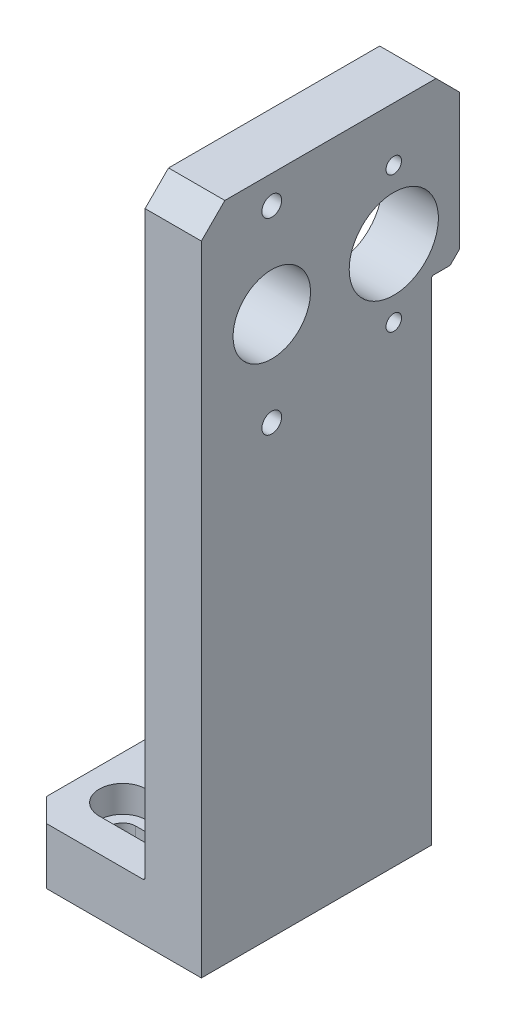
ISO-10303-21;
HEADER;
FILE_DESCRIPTION(('STEP AP214'),'2;1');
FILE_NAME('part.step','',(''),(''),'','','');
FILE_SCHEMA(('AUTOMOTIVE_DESIGN { 1 0 10303 214 1 1 1 1 }'));
ENDSEC;
DATA;
#1=APPLICATION_CONTEXT('core data for automotive mechanical design processes');
#2=APPLICATION_PROTOCOL_DEFINITION('international standard','automotive_design',2000,#1);
#3=PRODUCT_CONTEXT('',#1,'mechanical');
#4=PRODUCT('Part','Part','',(#3));
#5=PRODUCT_RELATED_PRODUCT_CATEGORY('part','',(#4));
#6=PRODUCT_DEFINITION_FORMATION('','',#4);
#7=PRODUCT_DEFINITION_CONTEXT('part definition',#1,'design');
#8=PRODUCT_DEFINITION('design','',#6,#7);
#9=PRODUCT_DEFINITION_SHAPE('','',#8);
#10=(LENGTH_UNIT() NAMED_UNIT(*) SI_UNIT(.MILLI.,.METRE.));
#11=(NAMED_UNIT(*) PLANE_ANGLE_UNIT() SI_UNIT($,.RADIAN.));
#12=(NAMED_UNIT(*) SI_UNIT($,.STERADIAN.) SOLID_ANGLE_UNIT());
#13=UNCERTAINTY_MEASURE_WITH_UNIT(LENGTH_MEASURE(1.E-05),#10,'distance_accuracy_value','');
#14=(GEOMETRIC_REPRESENTATION_CONTEXT(3) GLOBAL_UNCERTAINTY_ASSIGNED_CONTEXT((#13)) GLOBAL_UNIT_ASSIGNED_CONTEXT((#10,
#11,#12)) REPRESENTATION_CONTEXT('',''));
#15=CARTESIAN_POINT('',(0.,0.,0.));
#16=DIRECTION('',(0.,0.,1.));
#17=DIRECTION('',(1.,0.,0.));
#18=AXIS2_PLACEMENT_3D('',#15,#16,#17);
#19=CARTESIAN_POINT('',(0.,0.,55.));
#20=DIRECTION('',(0.,1.,0.));
#21=DIRECTION('',(-1.,0.,0.));
#22=AXIS2_PLACEMENT_3D('',#19,#20,#21);
#23=PLANE('',#22);
#24=DIRECTION('',(1.,0.,0.));
#25=VECTOR('',#24,1.);
#26=CARTESIAN_POINT('',(-28.75,0.,40.25));
#27=LINE('',#26,#25);
#28=CARTESIAN_POINT('',(-28.75,0.,40.25));
#29=VERTEX_POINT('',#28);
#30=CARTESIAN_POINT('',(-19.25,0.,40.25));
#31=VERTEX_POINT('',#30);
#32=EDGE_CURVE('E481',#29,#31,#27,.T.);
#33=ORIENTED_EDGE('',*,*,#32,.F.);
#34=CARTESIAN_POINT('',(-28.75,0.,43.));
#35=DIRECTION('',(0.,1.,0.));
#36=DIRECTION('',(0.,0.,1.));
#37=AXIS2_PLACEMENT_3D('',#34,#35,#36);
#38=CIRCLE('',#37,2.75);
#39=CARTESIAN_POINT('',(-28.75,0.,45.75));
#40=VERTEX_POINT('',#39);
#41=EDGE_CURVE('E503',#29,#40,#38,.T.);
#42=ORIENTED_EDGE('',*,*,#41,.T.);
#43=DIRECTION('',(1.,0.,0.));
#44=VECTOR('',#43,1.);
#45=CARTESIAN_POINT('',(-28.75,0.,45.75));
#46=LINE('',#45,#44);
#47=CARTESIAN_POINT('',(-19.25,0.,45.75));
#48=VERTEX_POINT('',#47);
#49=EDGE_CURVE('E478',#40,#48,#46,.T.);
#50=ORIENTED_EDGE('',*,*,#49,.T.);
#51=CARTESIAN_POINT('',(-19.25,0.,43.));
#52=DIRECTION('',(0.,1.,0.));
#53=DIRECTION('',(0.,0.,1.));
#54=AXIS2_PLACEMENT_3D('',#51,#52,#53);
#55=CIRCLE('',#54,2.75);
#56=EDGE_CURVE('E526',#48,#31,#55,.T.);
#57=ORIENTED_EDGE('',*,*,#56,.T.);
#58=EDGE_LOOP('',(#33,#42,#50,#57));
#59=FACE_BOUND('',#58,.T.);
#60=DIRECTION('',(0.,0.,-1.));
#61=VECTOR('',#60,1.);
#62=CARTESIAN_POINT('',(-38.,0.,55.));
#63=LINE('',#62,#61);
#64=CARTESIAN_POINT('',(-38.,0.,50.));
#65=VERTEX_POINT('',#64);
#66=CARTESIAN_POINT('',(-38.,0.,11.));
#67=VERTEX_POINT('',#66);
#68=EDGE_CURVE('E247',#65,#67,#63,.T.);
#69=ORIENTED_EDGE('',*,*,#68,.T.);
#70=DIRECTION('',(-0.70710678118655,0.,0.707106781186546));
#71=VECTOR('',#70,1.);
#72=CARTESIAN_POINT('',(-38.,0.,11.));
#73=LINE('',#72,#71);
#74=CARTESIAN_POINT('',(-33.,0.,6.));
#75=VERTEX_POINT('',#74);
#76=EDGE_CURVE('E229',#67,#75,#73,.F.);
#77=ORIENTED_EDGE('',*,*,#76,.T.);
#78=DIRECTION('',(1.,0.,0.));
#79=VECTOR('',#78,1.);
#80=CARTESIAN_POINT('',(-38.,0.,6.));
#81=LINE('',#80,#79);
#82=CARTESIAN_POINT('',(0.,0.,6.));
#83=VERTEX_POINT('',#82);
#84=EDGE_CURVE('E221',#75,#83,#81,.T.);
#85=ORIENTED_EDGE('',*,*,#84,.T.);
#86=DIRECTION('',(0.,0.,-1.));
#87=VECTOR('',#86,1.);
#88=CARTESIAN_POINT('',(0.,0.,55.));
#89=LINE('',#88,#87);
#90=CARTESIAN_POINT('',(0.,0.,55.));
#91=VERTEX_POINT('',#90);
#92=EDGE_CURVE('E227',#91,#83,#89,.T.);
#93=ORIENTED_EDGE('',*,*,#92,.F.);
#94=DIRECTION('',(1.,0.,0.));
#95=VECTOR('',#94,1.);
#96=CARTESIAN_POINT('',(0.,0.,55.));
#97=LINE('',#96,#95);
#98=CARTESIAN_POINT('',(-33.,0.,55.));
#99=VERTEX_POINT('',#98);
#100=EDGE_CURVE('E248',#99,#91,#97,.T.);
#101=ORIENTED_EDGE('',*,*,#100,.F.);
#102=DIRECTION('',(-0.707106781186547,0.,-0.707106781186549));
#103=VECTOR('',#102,1.);
#104=CARTESIAN_POINT('',(-33.,0.,55.));
#105=LINE('',#104,#103);
#106=EDGE_CURVE('E317',#99,#65,#105,.T.);
#107=ORIENTED_EDGE('',*,*,#106,.T.);
#108=EDGE_LOOP('',(#69,#77,#85,#93,#101,#107));
#109=FACE_BOUND('',#108,.T.);
#110=DIRECTION('',(1.,0.,0.));
#111=VECTOR('',#110,1.);
#112=CARTESIAN_POINT('',(-28.75,0.,9.25));
#113=LINE('',#112,#111);
#114=CARTESIAN_POINT('',(-28.75,0.,9.25));
#115=VERTEX_POINT('',#114);
#116=CARTESIAN_POINT('',(-19.25,0.,9.25));
#117=VERTEX_POINT('',#116);
#118=EDGE_CURVE('E417',#115,#117,#113,.T.);
#119=ORIENTED_EDGE('',*,*,#118,.F.);
#120=CARTESIAN_POINT('',(-28.75,0.,12.));
#121=DIRECTION('',(0.,1.,0.));
#122=DIRECTION('',(0.,0.,1.));
#123=AXIS2_PLACEMENT_3D('',#120,#121,#122);
#124=CIRCLE('',#123,2.75);
#125=CARTESIAN_POINT('',(-28.75,0.,14.75));
#126=VERTEX_POINT('',#125);
#127=EDGE_CURVE('E439',#115,#126,#124,.T.);
#128=ORIENTED_EDGE('',*,*,#127,.T.);
#129=DIRECTION('',(1.,0.,0.));
#130=VECTOR('',#129,1.);
#131=CARTESIAN_POINT('',(-28.75,0.,14.75));
#132=LINE('',#131,#130);
#133=CARTESIAN_POINT('',(-19.25,0.,14.75));
#134=VERTEX_POINT('',#133);
#135=EDGE_CURVE('E414',#126,#134,#132,.T.);
#136=ORIENTED_EDGE('',*,*,#135,.T.);
#137=CARTESIAN_POINT('',(-19.25,0.,12.));
#138=DIRECTION('',(0.,1.,0.));
#139=DIRECTION('',(0.,0.,1.));
#140=AXIS2_PLACEMENT_3D('',#137,#138,#139);
#141=CIRCLE('',#140,2.75);
#142=EDGE_CURVE('E462',#134,#117,#141,.T.);
#143=ORIENTED_EDGE('',*,*,#142,.T.);
#144=EDGE_LOOP('',(#119,#128,#136,#143));
#145=FACE_BOUND('',#144,.T.);
#146=ADVANCED_FACE('F16',(#59,#109,#145),#23,.F.);
#147=CARTESIAN_POINT('',(0.,0.,55.));
#148=DIRECTION('',(-1.,0.,0.));
#149=DIRECTION('',(0.,0.,1.));
#150=AXIS2_PLACEMENT_3D('',#147,#148,#149);
#151=PLANE('',#150);
#152=CARTESIAN_POINT('',(0.,135.,40.));
#153=DIRECTION('',(-1.,0.,0.));
#154=DIRECTION('',(0.,0.,1.));
#155=AXIS2_PLACEMENT_3D('',#152,#153,#154);
#156=CIRCLE('',#155,2.1);
#157=CARTESIAN_POINT('',(0.,135.,42.1));
#158=VERTEX_POINT('',#157);
#159=EDGE_CURVE('E537',#158,#158,#156,.T.);
#160=ORIENTED_EDGE('',*,*,#159,.T.);
#161=EDGE_LOOP('',(#160));
#162=FACE_BOUND('',#161,.T.);
#163=CARTESIAN_POINT('',(0.,95.,40.));
#164=DIRECTION('',(-1.,0.,0.));
#165=DIRECTION('',(0.,0.,1.));
#166=AXIS2_PLACEMENT_3D('',#163,#164,#165);
#167=CIRCLE('',#166,2.1);
#168=CARTESIAN_POINT('',(0.,95.,42.1));
#169=VERTEX_POINT('',#168);
#170=EDGE_CURVE('E543',#169,#169,#167,.T.);
#171=ORIENTED_EDGE('',*,*,#170,.T.);
#172=EDGE_LOOP('',(#171));
#173=FACE_BOUND('',#172,.T.);
#174=CARTESIAN_POINT('',(0.,129.5,14.));
#175=DIRECTION('',(-1.,0.,0.));
#176=DIRECTION('',(0.,0.,1.));
#177=AXIS2_PLACEMENT_3D('',#174,#175,#176);
#178=CIRCLE('',#177,1.65);
#179=CARTESIAN_POINT('',(0.,129.5,15.65));
#180=VERTEX_POINT('',#179);
#181=EDGE_CURVE('E549',#180,#180,#178,.T.);
#182=ORIENTED_EDGE('',*,*,#181,.T.);
#183=EDGE_LOOP('',(#182));
#184=FACE_BOUND('',#183,.T.);
#185=CARTESIAN_POINT('',(0.,100.5,14.));
#186=DIRECTION('',(-1.,0.,0.));
#187=DIRECTION('',(0.,0.,1.));
#188=AXIS2_PLACEMENT_3D('',#185,#186,#187);
#189=CIRCLE('',#188,1.65);
#190=CARTESIAN_POINT('',(0.,100.5,15.65));
#191=VERTEX_POINT('',#190);
#192=EDGE_CURVE('E555',#191,#191,#189,.T.);
#193=ORIENTED_EDGE('',*,*,#192,.T.);
#194=EDGE_LOOP('',(#193));
#195=FACE_BOUND('',#194,.T.);
#196=CARTESIAN_POINT('',(0.,115.,14.));
#197=DIRECTION('',(-1.,0.,0.));
#198=DIRECTION('',(0.,0.,1.));
#199=AXIS2_PLACEMENT_3D('',#196,#197,#198);
#200=CIRCLE('',#199,9.5);
#201=CARTESIAN_POINT('',(0.,115.,23.5));
#202=VERTEX_POINT('',#201);
#203=EDGE_CURVE('E561',#202,#202,#200,.T.);
#204=ORIENTED_EDGE('',*,*,#203,.T.);
#205=EDGE_LOOP('',(#204));
#206=FACE_BOUND('',#205,.T.);
#207=CARTESIAN_POINT('',(0.,115.,40.));
#208=DIRECTION('',(-1.,0.,0.));
#209=DIRECTION('',(0.,0.,1.));
#210=AXIS2_PLACEMENT_3D('',#207,#208,#209);
#211=CIRCLE('',#210,8.25);
#212=CARTESIAN_POINT('',(0.,115.,48.25));
#213=VERTEX_POINT('',#212);
#214=EDGE_CURVE('E567',#213,#213,#211,.T.);
#215=ORIENTED_EDGE('',*,*,#214,.T.);
#216=EDGE_LOOP('',(#215));
#217=FACE_BOUND('',#216,.T.);
#218=DIRECTION('',(0.,0.,1.));
#219=VECTOR('',#218,1.);
#220=CARTESIAN_POINT('',(0.,105.,0.));
#221=LINE('',#220,#219);
#222=CARTESIAN_POINT('',(0.,105.,2.));
#223=VERTEX_POINT('',#222);
#224=CARTESIAN_POINT('',(0.,105.,5.5));
#225=VERTEX_POINT('',#224);
#226=EDGE_CURVE('E241',#223,#225,#221,.T.);
#227=ORIENTED_EDGE('',*,*,#226,.F.);
#228=DIRECTION('',(0.,-0.70710678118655,0.707106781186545));
#229=VECTOR('',#228,1.);
#230=CARTESIAN_POINT('',(0.,105.,2.));
#231=LINE('',#230,#229);
#232=CARTESIAN_POINT('',(0.,107.,0.));
#233=VERTEX_POINT('',#232);
#234=EDGE_CURVE('E306',#223,#233,#231,.F.);
#235=ORIENTED_EDGE('',*,*,#234,.T.);
#236=DIRECTION('',(0.,1.,0.));
#237=VECTOR('',#236,1.);
#238=CARTESIAN_POINT('',(0.,0.,0.));
#239=LINE('',#238,#237);
#240=CARTESIAN_POINT('',(0.,136.,0.));
#241=VERTEX_POINT('',#240);
#242=EDGE_CURVE('E570',#233,#241,#239,.T.);
#243=ORIENTED_EDGE('',*,*,#242,.T.);
#244=DIRECTION('',(0.,-0.707106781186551,-0.707106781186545));
#245=VECTOR('',#244,1.);
#246=CARTESIAN_POINT('',(0.,141.,5.));
#247=LINE('',#246,#245);
#248=CARTESIAN_POINT('',(0.,141.,5.));
#249=VERTEX_POINT('',#248);
#250=EDGE_CURVE('E280',#241,#249,#247,.F.);
#251=ORIENTED_EDGE('',*,*,#250,.T.);
#252=DIRECTION('',(0.,0.,-1.));
#253=VECTOR('',#252,1.);
#254=CARTESIAN_POINT('',(0.,141.,55.));
#255=LINE('',#254,#253);
#256=CARTESIAN_POINT('',(0.,141.,50.));
#257=VERTEX_POINT('',#256);
#258=EDGE_CURVE('E263',#257,#249,#255,.T.);
#259=ORIENTED_EDGE('',*,*,#258,.F.);
#260=DIRECTION('',(0.,-0.707106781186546,0.70710678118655));
#261=VECTOR('',#260,1.);
#262=CARTESIAN_POINT('',(0.,136.,55.));
#263=LINE('',#262,#261);
#264=CARTESIAN_POINT('',(0.,136.,55.));
#265=VERTEX_POINT('',#264);
#266=EDGE_CURVE('E278',#257,#265,#263,.T.);
#267=ORIENTED_EDGE('',*,*,#266,.T.);
#268=DIRECTION('',(0.,1.,0.));
#269=VECTOR('',#268,1.);
#270=CARTESIAN_POINT('',(0.,0.,55.));
#271=LINE('',#270,#269);
#272=EDGE_CURVE('E246',#91,#265,#271,.T.);
#273=ORIENTED_EDGE('',*,*,#272,.F.);
#274=ORIENTED_EDGE('',*,*,#92,.T.);
#275=DIRECTION('',(0.,-1.,0.));
#276=VECTOR('',#275,1.);
#277=CARTESIAN_POINT('',(0.,0.,6.));
#278=LINE('',#277,#276);
#279=CARTESIAN_POINT('',(0.,104.5,6.));
#280=VERTEX_POINT('',#279);
#281=EDGE_CURVE('E231',#280,#83,#278,.T.);
#282=ORIENTED_EDGE('',*,*,#281,.F.);
#283=CARTESIAN_POINT('',(0.,104.5,5.5));
#284=DIRECTION('',(-1.,0.,0.));
#285=DIRECTION('',(0.,0.,1.));
#286=AXIS2_PLACEMENT_3D('',#283,#284,#285);
#287=CIRCLE('',#286,0.5);
#288=EDGE_CURVE('E299',#280,#225,#287,.T.);
#289=ORIENTED_EDGE('',*,*,#288,.T.);
#290=EDGE_LOOP('',(#227,#235,#243,#251,#259,#267,#273,#274,#282,#289));
#291=FACE_BOUND('',#290,.T.);
#292=ADVANCED_FACE('F244',(#162,#173,#184,#195,#206,#217,#291),#151,.F.);
#293=CARTESIAN_POINT('',(0.,141.,55.));
#294=DIRECTION('',(0.,-1.,0.));
#295=DIRECTION('',(0.,0.,-1.));
#296=AXIS2_PLACEMENT_3D('',#293,#294,#295);
#297=PLANE('',#296);
#298=ORIENTED_EDGE('',*,*,#258,.T.);
#299=DIRECTION('',(-1.,0.,0.));
#300=VECTOR('',#299,1.);
#301=CARTESIAN_POINT('',(0.,141.,5.));
#302=LINE('',#301,#300);
#303=CARTESIAN_POINT('',(-12.,141.,5.));
#304=VERTEX_POINT('',#303);
#305=EDGE_CURVE('E268',#249,#304,#302,.T.);
#306=ORIENTED_EDGE('',*,*,#305,.T.);
#307=DIRECTION('',(0.,0.,-1.));
#308=VECTOR('',#307,1.);
#309=CARTESIAN_POINT('',(-12.,141.,55.));
#310=LINE('',#309,#308);
#311=CARTESIAN_POINT('',(-12.,141.,50.));
#312=VERTEX_POINT('',#311);
#313=EDGE_CURVE('E260',#312,#304,#310,.T.);
#314=ORIENTED_EDGE('',*,*,#313,.F.);
#315=DIRECTION('',(1.,0.,0.));
#316=VECTOR('',#315,1.);
#317=CARTESIAN_POINT('',(0.,141.,50.));
#318=LINE('',#317,#316);
#319=EDGE_CURVE('E266',#312,#257,#318,.T.);
#320=ORIENTED_EDGE('',*,*,#319,.T.);
#321=EDGE_LOOP('',(#298,#306,#314,#320));
#322=FACE_BOUND('',#321,.T.);
#323=ADVANCED_FACE('F349',(#322),#297,.F.);
#324=CARTESIAN_POINT('',(-12.,12.,55.));
#325=DIRECTION('',(1.,0.,0.));
#326=DIRECTION('',(0.,0.,-1.));
#327=AXIS2_PLACEMENT_3D('',#324,#325,#326);
#328=PLANE('',#327);
#329=CARTESIAN_POINT('',(-12.,135.,40.));
#330=DIRECTION('',(-1.,0.,0.));
#331=DIRECTION('',(0.,0.,1.));
#332=AXIS2_PLACEMENT_3D('',#329,#330,#331);
#333=CIRCLE('',#332,2.1);
#334=CARTESIAN_POINT('',(-12.,135.,42.1));
#335=VERTEX_POINT('',#334);
#336=EDGE_CURVE('E534',#335,#335,#333,.T.);
#337=ORIENTED_EDGE('',*,*,#336,.F.);
#338=EDGE_LOOP('',(#337));
#339=FACE_BOUND('',#338,.T.);
#340=CARTESIAN_POINT('',(-12.,95.,40.));
#341=DIRECTION('',(-1.,0.,0.));
#342=DIRECTION('',(0.,0.,1.));
#343=AXIS2_PLACEMENT_3D('',#340,#341,#342);
#344=CIRCLE('',#343,2.1);
#345=CARTESIAN_POINT('',(-12.,95.,42.1));
#346=VERTEX_POINT('',#345);
#347=EDGE_CURVE('E540',#346,#346,#344,.T.);
#348=ORIENTED_EDGE('',*,*,#347,.F.);
#349=EDGE_LOOP('',(#348));
#350=FACE_BOUND('',#349,.T.);
#351=CARTESIAN_POINT('',(-12.,129.5,14.));
#352=DIRECTION('',(-1.,0.,0.));
#353=DIRECTION('',(0.,0.,1.));
#354=AXIS2_PLACEMENT_3D('',#351,#352,#353);
#355=CIRCLE('',#354,1.65);
#356=CARTESIAN_POINT('',(-12.,129.5,15.65));
#357=VERTEX_POINT('',#356);
#358=EDGE_CURVE('E546',#357,#357,#355,.T.);
#359=ORIENTED_EDGE('',*,*,#358,.F.);
#360=EDGE_LOOP('',(#359));
#361=FACE_BOUND('',#360,.T.);
#362=CARTESIAN_POINT('',(-12.,100.5,14.));
#363=DIRECTION('',(-1.,0.,0.));
#364=DIRECTION('',(0.,0.,1.));
#365=AXIS2_PLACEMENT_3D('',#362,#363,#364);
#366=CIRCLE('',#365,1.65);
#367=CARTESIAN_POINT('',(-12.,100.5,15.65));
#368=VERTEX_POINT('',#367);
#369=EDGE_CURVE('E552',#368,#368,#366,.T.);
#370=ORIENTED_EDGE('',*,*,#369,.F.);
#371=EDGE_LOOP('',(#370));
#372=FACE_BOUND('',#371,.T.);
#373=CARTESIAN_POINT('',(-12.,115.,14.));
#374=DIRECTION('',(-1.,0.,0.));
#375=DIRECTION('',(0.,0.,1.));
#376=AXIS2_PLACEMENT_3D('',#373,#374,#375);
#377=CIRCLE('',#376,9.5);
#378=CARTESIAN_POINT('',(-12.,115.,23.5));
#379=VERTEX_POINT('',#378);
#380=EDGE_CURVE('E558',#379,#379,#377,.T.);
#381=ORIENTED_EDGE('',*,*,#380,.F.);
#382=EDGE_LOOP('',(#381));
#383=FACE_BOUND('',#382,.T.);
#384=CARTESIAN_POINT('',(-12.,115.,40.));
#385=DIRECTION('',(-1.,0.,0.));
#386=DIRECTION('',(0.,0.,1.));
#387=AXIS2_PLACEMENT_3D('',#384,#385,#386);
#388=CIRCLE('',#387,8.25);
#389=CARTESIAN_POINT('',(-12.,115.,48.25));
#390=VERTEX_POINT('',#389);
#391=EDGE_CURVE('E564',#390,#390,#388,.T.);
#392=ORIENTED_EDGE('',*,*,#391,.F.);
#393=EDGE_LOOP('',(#392));
#394=FACE_BOUND('',#393,.T.);
#395=DIRECTION('',(0.,-1.,0.));
#396=VECTOR('',#395,1.);
#397=CARTESIAN_POINT('',(-12.,12.,0.));
#398=LINE('',#397,#396);
#399=CARTESIAN_POINT('',(-12.,136.,0.));
#400=VERTEX_POINT('',#399);
#401=CARTESIAN_POINT('',(-12.,107.,0.));
#402=VERTEX_POINT('',#401);
#403=EDGE_CURVE('E255',#400,#402,#398,.T.);
#404=ORIENTED_EDGE('',*,*,#403,.T.);
#405=DIRECTION('',(0.,0.70710678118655,-0.707106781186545));
#406=VECTOR('',#405,1.);
#407=CARTESIAN_POINT('',(-12.,105.,2.));
#408=LINE('',#407,#406);
#409=CARTESIAN_POINT('',(-12.,105.,2.));
#410=VERTEX_POINT('',#409);
#411=EDGE_CURVE('E310',#402,#410,#408,.F.);
#412=ORIENTED_EDGE('',*,*,#411,.T.);
#413=DIRECTION('',(0.,0.,1.));
#414=VECTOR('',#413,1.);
#415=CARTESIAN_POINT('',(-12.,105.,55.));
#416=LINE('',#415,#414);
#417=CARTESIAN_POINT('',(-12.,105.,5.5));
#418=VERTEX_POINT('',#417);
#419=EDGE_CURVE('E400',#410,#418,#416,.T.);
#420=ORIENTED_EDGE('',*,*,#419,.T.);
#421=CARTESIAN_POINT('',(-12.,104.5,5.5));
#422=DIRECTION('',(1.,0.,0.));
#423=DIRECTION('',(0.,0.,-1.));
#424=AXIS2_PLACEMENT_3D('',#421,#422,#423);
#425=CIRCLE('',#424,0.5);
#426=CARTESIAN_POINT('',(-12.,104.5,6.));
#427=VERTEX_POINT('',#426);
#428=EDGE_CURVE('E301',#418,#427,#425,.T.);
#429=ORIENTED_EDGE('',*,*,#428,.T.);
#430=DIRECTION('',(0.,-1.,0.));
#431=VECTOR('',#430,1.);
#432=CARTESIAN_POINT('',(-12.,12.,6.));
#433=LINE('',#432,#431);
#434=CARTESIAN_POINT('',(-12.,12.5,6.));
#435=VERTEX_POINT('',#434);
#436=EDGE_CURVE('E397',#427,#435,#433,.T.);
#437=ORIENTED_EDGE('',*,*,#436,.T.);
#438=DIRECTION('',(0.,0.,-1.));
#439=VECTOR('',#438,1.);
#440=CARTESIAN_POINT('',(-12.,12.5,55.));
#441=LINE('',#440,#439);
#442=CARTESIAN_POINT('',(-12.,12.5,55.));
#443=VERTEX_POINT('',#442);
#444=EDGE_CURVE('E288',#435,#443,#441,.F.);
#445=ORIENTED_EDGE('',*,*,#444,.T.);
#446=DIRECTION('',(0.,-1.,0.));
#447=VECTOR('',#446,1.);
#448=CARTESIAN_POINT('',(-12.,12.,55.));
#449=LINE('',#448,#447);
#450=CARTESIAN_POINT('',(-12.,136.,55.));
#451=VERTEX_POINT('',#450);
#452=EDGE_CURVE('E572',#451,#443,#449,.T.);
#453=ORIENTED_EDGE('',*,*,#452,.F.);
#454=DIRECTION('',(0.,0.707106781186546,-0.70710678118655));
#455=VECTOR('',#454,1.);
#456=CARTESIAN_POINT('',(-12.,136.,55.));
#457=LINE('',#456,#455);
#458=EDGE_CURVE('E271',#451,#312,#457,.T.);
#459=ORIENTED_EDGE('',*,*,#458,.T.);
#460=ORIENTED_EDGE('',*,*,#313,.T.);
#461=DIRECTION('',(0.,0.707106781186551,0.707106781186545));
#462=VECTOR('',#461,1.);
#463=CARTESIAN_POINT('',(-12.,141.,5.));
#464=LINE('',#463,#462);
#465=EDGE_CURVE('E273',#304,#400,#464,.F.);
#466=ORIENTED_EDGE('',*,*,#465,.T.);
#467=EDGE_LOOP('',(#404,#412,#420,#429,#437,#445,#453,#459,#460,#466));
#468=FACE_BOUND('',#467,.T.);
#469=ADVANCED_FACE('F362',(#339,#350,#361,#372,#383,#394,#468),#328,.F.);
#470=CARTESIAN_POINT('',(-12.,12.,55.));
#471=DIRECTION('',(0.,-1.,0.));
#472=DIRECTION('',(1.,0.,0.));
#473=AXIS2_PLACEMENT_3D('',#470,#471,#472);
#474=PLANE('',#473);
#475=CARTESIAN_POINT('',(-28.75,12.,12.));
#476=DIRECTION('',(0.,1.,0.));
#477=DIRECTION('',(0.,0.,1.));
#478=AXIS2_PLACEMENT_3D('',#475,#476,#477);
#479=CIRCLE('',#478,5.);
#480=CARTESIAN_POINT('',(-28.75,12.,7.));
#481=VERTEX_POINT('',#480);
#482=CARTESIAN_POINT('',(-28.75,12.,17.));
#483=VERTEX_POINT('',#482);
#484=EDGE_CURVE('E431',#481,#483,#479,.T.);
#485=ORIENTED_EDGE('',*,*,#484,.F.);
#486=DIRECTION('',(1.,0.,0.));
#487=VECTOR('',#486,1.);
#488=CARTESIAN_POINT('',(-28.75,12.,7.));
#489=LINE('',#488,#487);
#490=CARTESIAN_POINT('',(-19.25,12.,7.));
#491=VERTEX_POINT('',#490);
#492=EDGE_CURVE('E423',#481,#491,#489,.T.);
#493=ORIENTED_EDGE('',*,*,#492,.T.);
#494=CARTESIAN_POINT('',(-19.25,12.,12.));
#495=DIRECTION('',(0.,1.,0.));
#496=DIRECTION('',(0.,0.,1.));
#497=AXIS2_PLACEMENT_3D('',#494,#495,#496);
#498=CIRCLE('',#497,5.);
#499=CARTESIAN_POINT('',(-19.25,12.,17.));
#500=VERTEX_POINT('',#499);
#501=EDGE_CURVE('E453',#500,#491,#498,.T.);
#502=ORIENTED_EDGE('',*,*,#501,.F.);
#503=DIRECTION('',(1.,0.,0.));
#504=VECTOR('',#503,1.);
#505=CARTESIAN_POINT('',(-28.75,12.,17.));
#506=LINE('',#505,#504);
#507=EDGE_CURVE('E403',#483,#500,#506,.T.);
#508=ORIENTED_EDGE('',*,*,#507,.F.);
#509=EDGE_LOOP('',(#485,#493,#502,#508));
#510=FACE_BOUND('',#509,.T.);
#511=CARTESIAN_POINT('',(-28.75,12.,43.));
#512=DIRECTION('',(0.,1.,0.));
#513=DIRECTION('',(0.,0.,1.));
#514=AXIS2_PLACEMENT_3D('',#511,#512,#513);
#515=CIRCLE('',#514,5.);
#516=CARTESIAN_POINT('',(-28.75,12.,38.));
#517=VERTEX_POINT('',#516);
#518=CARTESIAN_POINT('',(-28.75,12.,48.));
#519=VERTEX_POINT('',#518);
#520=EDGE_CURVE('E495',#517,#519,#515,.T.);
#521=ORIENTED_EDGE('',*,*,#520,.F.);
#522=DIRECTION('',(1.,0.,0.));
#523=VECTOR('',#522,1.);
#524=CARTESIAN_POINT('',(-28.75,12.,38.));
#525=LINE('',#524,#523);
#526=CARTESIAN_POINT('',(-19.25,12.,38.));
#527=VERTEX_POINT('',#526);
#528=EDGE_CURVE('E487',#517,#527,#525,.T.);
#529=ORIENTED_EDGE('',*,*,#528,.T.);
#530=CARTESIAN_POINT('',(-19.25,12.,43.));
#531=DIRECTION('',(0.,1.,0.));
#532=DIRECTION('',(0.,0.,1.));
#533=AXIS2_PLACEMENT_3D('',#530,#531,#532);
#534=CIRCLE('',#533,5.);
#535=CARTESIAN_POINT('',(-19.25,12.,48.));
#536=VERTEX_POINT('',#535);
#537=EDGE_CURVE('E517',#536,#527,#534,.T.);
#538=ORIENTED_EDGE('',*,*,#537,.F.);
#539=DIRECTION('',(1.,0.,0.));
#540=VECTOR('',#539,1.);
#541=CARTESIAN_POINT('',(-28.75,12.,48.));
#542=LINE('',#541,#540);
#543=EDGE_CURVE('E470',#519,#536,#542,.T.);
#544=ORIENTED_EDGE('',*,*,#543,.F.);
#545=EDGE_LOOP('',(#521,#529,#538,#544));
#546=FACE_BOUND('',#545,.T.);
#547=DIRECTION('',(-1.,0.,0.));
#548=VECTOR('',#547,1.);
#549=CARTESIAN_POINT('',(-12.,12.,6.));
#550=LINE('',#549,#548);
#551=CARTESIAN_POINT('',(-12.5,12.,6.));
#552=VERTEX_POINT('',#551);
#553=CARTESIAN_POINT('',(-33.,12.,6.));
#554=VERTEX_POINT('',#553);
#555=EDGE_CURVE('E230',#552,#554,#550,.T.);
#556=ORIENTED_EDGE('',*,*,#555,.T.);
#557=DIRECTION('',(0.70710678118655,0.,-0.707106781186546));
#558=VECTOR('',#557,1.);
#559=CARTESIAN_POINT('',(-38.,12.,11.));
#560=LINE('',#559,#558);
#561=CARTESIAN_POINT('',(-38.,12.,11.));
#562=VERTEX_POINT('',#561);
#563=EDGE_CURVE('E24',#554,#562,#560,.F.);
#564=ORIENTED_EDGE('',*,*,#563,.T.);
#565=DIRECTION('',(0.,0.,-1.));
#566=VECTOR('',#565,1.);
#567=CARTESIAN_POINT('',(-38.,12.,55.));
#568=LINE('',#567,#566);
#569=CARTESIAN_POINT('',(-38.,12.,50.));
#570=VERTEX_POINT('',#569);
#571=EDGE_CURVE('E250',#570,#562,#568,.T.);
#572=ORIENTED_EDGE('',*,*,#571,.F.);
#573=DIRECTION('',(0.707106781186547,0.,0.707106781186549));
#574=VECTOR('',#573,1.);
#575=CARTESIAN_POINT('',(-33.,12.,55.));
#576=LINE('',#575,#574);
#577=CARTESIAN_POINT('',(-33.,12.,55.));
#578=VERTEX_POINT('',#577);
#579=EDGE_CURVE('E31',#570,#578,#576,.T.);
#580=ORIENTED_EDGE('',*,*,#579,.T.);
#581=DIRECTION('',(-1.,0.,0.));
#582=VECTOR('',#581,1.);
#583=CARTESIAN_POINT('',(-12.,12.,55.));
#584=LINE('',#583,#582);
#585=CARTESIAN_POINT('',(-12.5,12.,55.));
#586=VERTEX_POINT('',#585);
#587=EDGE_CURVE('E252',#586,#578,#584,.T.);
#588=ORIENTED_EDGE('',*,*,#587,.F.);
#589=DIRECTION('',(0.,0.,-1.));
#590=VECTOR('',#589,1.);
#591=CARTESIAN_POINT('',(-12.5,12.,0.));
#592=LINE('',#591,#590);
#593=EDGE_CURVE('E285',#586,#552,#592,.T.);
#594=ORIENTED_EDGE('',*,*,#593,.T.);
#595=EDGE_LOOP('',(#556,#564,#572,#580,#588,#594));
#596=FACE_BOUND('',#595,.T.);
#597=ADVANCED_FACE('F322',(#510,#546,#596),#474,.F.);
#598=CARTESIAN_POINT('',(-38.,0.,55.));
#599=DIRECTION('',(1.,0.,0.));
#600=DIRECTION('',(0.,0.,-1.));
#601=AXIS2_PLACEMENT_3D('',#598,#599,#600);
#602=PLANE('',#601);
#603=ORIENTED_EDGE('',*,*,#571,.T.);
#604=DIRECTION('',(0.,-1.,0.));
#605=VECTOR('',#604,1.);
#606=CARTESIAN_POINT('',(-38.,0.,11.));
#607=LINE('',#606,#605);
#608=EDGE_CURVE('E314',#562,#67,#607,.T.);
#609=ORIENTED_EDGE('',*,*,#608,.T.);
#610=ORIENTED_EDGE('',*,*,#68,.F.);
#611=DIRECTION('',(0.,1.,0.));
#612=VECTOR('',#611,1.);
#613=CARTESIAN_POINT('',(-38.,12.,50.));
#614=LINE('',#613,#612);
#615=EDGE_CURVE('E312',#65,#570,#614,.T.);
#616=ORIENTED_EDGE('',*,*,#615,.T.);
#617=EDGE_LOOP('',(#603,#609,#610,#616));
#618=FACE_BOUND('',#617,.T.);
#619=ADVANCED_FACE('F326',(#618),#602,.F.);
#620=CARTESIAN_POINT('',(0.,0.,55.));
#621=DIRECTION('',(0.,0.,1.));
#622=DIRECTION('',(1.,0.,0.));
#623=AXIS2_PLACEMENT_3D('',#620,#621,#622);
#624=PLANE('',#623);
#625=ORIENTED_EDGE('',*,*,#587,.T.);
#626=DIRECTION('',(0.,-1.,0.));
#627=VECTOR('',#626,1.);
#628=CARTESIAN_POINT('',(-33.,0.,55.));
#629=LINE('',#628,#627);
#630=EDGE_CURVE('E11',#578,#99,#629,.T.);
#631=ORIENTED_EDGE('',*,*,#630,.T.);
#632=ORIENTED_EDGE('',*,*,#100,.T.);
#633=ORIENTED_EDGE('',*,*,#272,.T.);
#634=DIRECTION('',(-1.,0.,0.));
#635=VECTOR('',#634,1.);
#636=CARTESIAN_POINT('',(-12.,136.,55.));
#637=LINE('',#636,#635);
#638=EDGE_CURVE('E282',#265,#451,#637,.T.);
#639=ORIENTED_EDGE('',*,*,#638,.T.);
#640=ORIENTED_EDGE('',*,*,#452,.T.);
#641=CARTESIAN_POINT('',(-12.5,12.5,55.));
#642=DIRECTION('',(0.,0.,1.));
#643=DIRECTION('',(1.,0.,0.));
#644=AXIS2_PLACEMENT_3D('',#641,#642,#643);
#645=CIRCLE('',#644,0.5);
#646=EDGE_CURVE('E290',#443,#586,#645,.F.);
#647=ORIENTED_EDGE('',*,*,#646,.T.);
#648=EDGE_LOOP('',(#625,#631,#632,#633,#639,#640,#647));
#649=FACE_BOUND('',#648,.T.);
#650=ADVANCED_FACE('F359',(#649),#624,.T.);
#651=CARTESIAN_POINT('',(0.,0.,0.));
#652=DIRECTION('',(0.,0.,1.));
#653=DIRECTION('',(1.,0.,0.));
#654=AXIS2_PLACEMENT_3D('',#651,#652,#653);
#655=PLANE('',#654);
#656=ORIENTED_EDGE('',*,*,#242,.F.);
#657=DIRECTION('',(-1.,0.,0.));
#658=VECTOR('',#657,1.);
#659=CARTESIAN_POINT('',(0.,107.,0.));
#660=LINE('',#659,#658);
#661=EDGE_CURVE('E308',#233,#402,#660,.T.);
#662=ORIENTED_EDGE('',*,*,#661,.T.);
#663=ORIENTED_EDGE('',*,*,#403,.F.);
#664=DIRECTION('',(1.,0.,0.));
#665=VECTOR('',#664,1.);
#666=CARTESIAN_POINT('',(0.,136.,0.));
#667=LINE('',#666,#665);
#668=EDGE_CURVE('E275',#400,#241,#667,.T.);
#669=ORIENTED_EDGE('',*,*,#668,.T.);
#670=EDGE_LOOP('',(#656,#662,#663,#669));
#671=FACE_BOUND('',#670,.T.);
#672=ADVANCED_FACE('F355',(#671),#655,.F.);
#673=CARTESIAN_POINT('',(-12.,115.,40.));
#674=DIRECTION('',(-1.,0.,0.));
#675=DIRECTION('',(0.,0.,1.));
#676=AXIS2_PLACEMENT_3D('',#673,#674,#675);
#677=CYLINDRICAL_SURFACE('',#676,8.25);
#678=ORIENTED_EDGE('',*,*,#391,.T.);
#679=EDGE_LOOP('',(#678));
#680=FACE_BOUND('',#679,.T.);
#681=ORIENTED_EDGE('',*,*,#214,.F.);
#682=EDGE_LOOP('',(#681));
#683=FACE_BOUND('',#682,.T.);
#684=ADVANCED_FACE('F601',(#680,#683),#677,.F.);
#685=CARTESIAN_POINT('',(-12.,115.,14.));
#686=DIRECTION('',(-1.,0.,0.));
#687=DIRECTION('',(0.,0.,1.));
#688=AXIS2_PLACEMENT_3D('',#685,#686,#687);
#689=CYLINDRICAL_SURFACE('',#688,9.5);
#690=ORIENTED_EDGE('',*,*,#203,.F.);
#691=EDGE_LOOP('',(#690));
#692=FACE_BOUND('',#691,.T.);
#693=ORIENTED_EDGE('',*,*,#380,.T.);
#694=EDGE_LOOP('',(#693));
#695=FACE_BOUND('',#694,.T.);
#696=ADVANCED_FACE('F374',(#692,#695),#689,.F.);
#697=CARTESIAN_POINT('',(0.,141.,5.));
#698=DIRECTION('',(0.,-0.707106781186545,0.707106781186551));
#699=DIRECTION('',(-1.,0.,0.));
#700=AXIS2_PLACEMENT_3D('',#697,#698,#699);
#701=PLANE('',#700);
#702=ORIENTED_EDGE('',*,*,#250,.F.);
#703=ORIENTED_EDGE('',*,*,#668,.F.);
#704=ORIENTED_EDGE('',*,*,#465,.F.);
#705=ORIENTED_EDGE('',*,*,#305,.F.);
#706=EDGE_LOOP('',(#702,#703,#704,#705));
#707=FACE_BOUND('',#706,.T.);
#708=ADVANCED_FACE('F370',(#707),#701,.F.);
#709=CARTESIAN_POINT('',(0.,136.,55.));
#710=DIRECTION('',(0.,0.70710678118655,0.707106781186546));
#711=DIRECTION('',(1.,0.,0.));
#712=AXIS2_PLACEMENT_3D('',#709,#710,#711);
#713=PLANE('',#712);
#714=ORIENTED_EDGE('',*,*,#266,.F.);
#715=ORIENTED_EDGE('',*,*,#319,.F.);
#716=ORIENTED_EDGE('',*,*,#458,.F.);
#717=ORIENTED_EDGE('',*,*,#638,.F.);
#718=EDGE_LOOP('',(#714,#715,#716,#717));
#719=FACE_BOUND('',#718,.T.);
#720=ADVANCED_FACE('F373',(#719),#713,.T.);
#721=CARTESIAN_POINT('',(-12.,100.5,14.));
#722=DIRECTION('',(-1.,0.,0.));
#723=DIRECTION('',(0.,0.,1.));
#724=AXIS2_PLACEMENT_3D('',#721,#722,#723);
#725=CYLINDRICAL_SURFACE('',#724,1.65);
#726=ORIENTED_EDGE('',*,*,#192,.F.);
#727=EDGE_LOOP('',(#726));
#728=FACE_BOUND('',#727,.T.);
#729=ORIENTED_EDGE('',*,*,#369,.T.);
#730=EDGE_LOOP('',(#729));
#731=FACE_BOUND('',#730,.T.);
#732=ADVANCED_FACE('F378',(#728,#731),#725,.F.);
#733=CARTESIAN_POINT('',(-12.,129.5,14.));
#734=DIRECTION('',(-1.,0.,0.));
#735=DIRECTION('',(0.,0.,1.));
#736=AXIS2_PLACEMENT_3D('',#733,#734,#735);
#737=CYLINDRICAL_SURFACE('',#736,1.65);
#738=ORIENTED_EDGE('',*,*,#181,.F.);
#739=EDGE_LOOP('',(#738));
#740=FACE_BOUND('',#739,.T.);
#741=ORIENTED_EDGE('',*,*,#358,.T.);
#742=EDGE_LOOP('',(#741));
#743=FACE_BOUND('',#742,.T.);
#744=ADVANCED_FACE('F611',(#740,#743),#737,.F.);
#745=CARTESIAN_POINT('',(-12.,95.,40.));
#746=DIRECTION('',(-1.,0.,0.));
#747=DIRECTION('',(0.,0.,1.));
#748=AXIS2_PLACEMENT_3D('',#745,#746,#747);
#749=CYLINDRICAL_SURFACE('',#748,2.1);
#750=ORIENTED_EDGE('',*,*,#170,.F.);
#751=EDGE_LOOP('',(#750));
#752=FACE_BOUND('',#751,.T.);
#753=ORIENTED_EDGE('',*,*,#347,.T.);
#754=EDGE_LOOP('',(#753));
#755=FACE_BOUND('',#754,.T.);
#756=ADVANCED_FACE('F615',(#752,#755),#749,.F.);
#757=CARTESIAN_POINT('',(-12.,135.,40.));
#758=DIRECTION('',(-1.,0.,0.));
#759=DIRECTION('',(0.,0.,1.));
#760=AXIS2_PLACEMENT_3D('',#757,#758,#759);
#761=CYLINDRICAL_SURFACE('',#760,2.1);
#762=ORIENTED_EDGE('',*,*,#159,.F.);
#763=EDGE_LOOP('',(#762));
#764=FACE_BOUND('',#763,.T.);
#765=ORIENTED_EDGE('',*,*,#336,.T.);
#766=EDGE_LOOP('',(#765));
#767=FACE_BOUND('',#766,.T.);
#768=ADVANCED_FACE('F619',(#764,#767),#761,.F.);
#769=CARTESIAN_POINT('',(-19.25,12.,43.));
#770=DIRECTION('',(0.,1.,0.));
#771=DIRECTION('',(0.,0.,1.));
#772=AXIS2_PLACEMENT_3D('',#769,#770,#771);
#773=CYLINDRICAL_SURFACE('',#772,2.75);
#774=ORIENTED_EDGE('',*,*,#56,.F.);
#775=DIRECTION('',(0.,1.,0.));
#776=VECTOR('',#775,1.);
#777=CARTESIAN_POINT('',(-19.25,12.,45.75));
#778=LINE('',#777,#776);
#779=CARTESIAN_POINT('',(-19.25,6.3,45.75));
#780=VERTEX_POINT('',#779);
#781=EDGE_CURVE('E515',#780,#48,#778,.F.);
#782=ORIENTED_EDGE('',*,*,#781,.F.);
#783=CARTESIAN_POINT('',(-19.25,6.3,43.));
#784=DIRECTION('',(0.,1.,0.));
#785=DIRECTION('',(0.,0.,1.));
#786=AXIS2_PLACEMENT_3D('',#783,#784,#785);
#787=CIRCLE('',#786,2.75);
#788=CARTESIAN_POINT('',(-19.25,6.3,40.25));
#789=VERTEX_POINT('',#788);
#790=EDGE_CURVE('E523',#780,#789,#787,.T.);
#791=ORIENTED_EDGE('',*,*,#790,.T.);
#792=DIRECTION('',(0.,1.,0.));
#793=VECTOR('',#792,1.);
#794=CARTESIAN_POINT('',(-19.25,12.,40.25));
#795=LINE('',#794,#793);
#796=EDGE_CURVE('E512',#31,#789,#795,.T.);
#797=ORIENTED_EDGE('',*,*,#796,.F.);
#798=EDGE_LOOP('',(#774,#782,#791,#797));
#799=FACE_BOUND('',#798,.T.);
#800=ADVANCED_FACE('F623',(#799),#773,.F.);
#801=CARTESIAN_POINT('',(-16.5,6.3,43.));
#802=DIRECTION('',(0.,-1.,0.));
#803=DIRECTION('',(0.,0.,-1.));
#804=AXIS2_PLACEMENT_3D('',#801,#802,#803);
#805=PLANE('',#804);
#806=DIRECTION('',(1.,0.,0.));
#807=VECTOR('',#806,1.);
#808=CARTESIAN_POINT('',(-28.75,6.3,45.75));
#809=LINE('',#808,#807);
#810=CARTESIAN_POINT('',(-28.75,6.3,45.75));
#811=VERTEX_POINT('',#810);
#812=EDGE_CURVE('E475',#811,#780,#809,.T.);
#813=ORIENTED_EDGE('',*,*,#812,.F.);
#814=CARTESIAN_POINT('',(-28.75,6.3,43.));
#815=DIRECTION('',(0.,1.,0.));
#816=DIRECTION('',(0.,0.,1.));
#817=AXIS2_PLACEMENT_3D('',#814,#815,#816);
#818=CIRCLE('',#817,2.75);
#819=CARTESIAN_POINT('',(-28.75,6.3,40.25));
#820=VERTEX_POINT('',#819);
#821=EDGE_CURVE('E500',#820,#811,#818,.T.);
#822=ORIENTED_EDGE('',*,*,#821,.F.);
#823=DIRECTION('',(1.,0.,0.));
#824=VECTOR('',#823,1.);
#825=CARTESIAN_POINT('',(-28.75,6.3,40.25));
#826=LINE('',#825,#824);
#827=EDGE_CURVE('E483',#820,#789,#826,.T.);
#828=ORIENTED_EDGE('',*,*,#827,.T.);
#829=ORIENTED_EDGE('',*,*,#790,.F.);
#830=EDGE_LOOP('',(#813,#822,#828,#829));
#831=FACE_BOUND('',#830,.T.);
#832=CARTESIAN_POINT('',(-19.25,6.3,43.));
#833=DIRECTION('',(0.,1.,0.));
#834=DIRECTION('',(0.,0.,1.));
#835=AXIS2_PLACEMENT_3D('',#832,#833,#834);
#836=CIRCLE('',#835,5.);
#837=CARTESIAN_POINT('',(-19.25,6.3,48.));
#838=VERTEX_POINT('',#837);
#839=CARTESIAN_POINT('',(-19.25,6.3,38.));
#840=VERTEX_POINT('',#839);
#841=EDGE_CURVE('E520',#838,#840,#836,.T.);
#842=ORIENTED_EDGE('',*,*,#841,.T.);
#843=DIRECTION('',(1.,0.,0.));
#844=VECTOR('',#843,1.);
#845=CARTESIAN_POINT('',(-28.75,6.3,38.));
#846=LINE('',#845,#844);
#847=CARTESIAN_POINT('',(-28.75,6.3,38.));
#848=VERTEX_POINT('',#847);
#849=EDGE_CURVE('E485',#848,#840,#846,.T.);
#850=ORIENTED_EDGE('',*,*,#849,.F.);
#851=CARTESIAN_POINT('',(-28.75,6.3,43.));
#852=DIRECTION('',(0.,1.,0.));
#853=DIRECTION('',(0.,0.,1.));
#854=AXIS2_PLACEMENT_3D('',#851,#852,#853);
#855=CIRCLE('',#854,5.);
#856=CARTESIAN_POINT('',(-28.75,6.3,48.));
#857=VERTEX_POINT('',#856);
#858=EDGE_CURVE('E497',#848,#857,#855,.T.);
#859=ORIENTED_EDGE('',*,*,#858,.T.);
#860=DIRECTION('',(1.,0.,0.));
#861=VECTOR('',#860,1.);
#862=CARTESIAN_POINT('',(-28.75,6.3,48.));
#863=LINE('',#862,#861);
#864=EDGE_CURVE('E472',#857,#838,#863,.T.);
#865=ORIENTED_EDGE('',*,*,#864,.T.);
#866=EDGE_LOOP('',(#842,#850,#859,#865));
#867=FACE_BOUND('',#866,.T.);
#868=ADVANCED_FACE('F627',(#831,#867),#805,.F.);
#869=CARTESIAN_POINT('',(-19.25,12.,43.));
#870=DIRECTION('',(0.,1.,0.));
#871=DIRECTION('',(0.,0.,1.));
#872=AXIS2_PLACEMENT_3D('',#869,#870,#871);
#873=CYLINDRICAL_SURFACE('',#872,5.);
#874=ORIENTED_EDGE('',*,*,#841,.F.);
#875=DIRECTION('',(0.,1.,0.));
#876=VECTOR('',#875,1.);
#877=CARTESIAN_POINT('',(-19.25,12.,48.));
#878=LINE('',#877,#876);
#879=EDGE_CURVE('E531',#536,#838,#878,.F.);
#880=ORIENTED_EDGE('',*,*,#879,.F.);
#881=ORIENTED_EDGE('',*,*,#537,.T.);
#882=DIRECTION('',(0.,1.,0.));
#883=VECTOR('',#882,1.);
#884=CARTESIAN_POINT('',(-19.25,12.,38.));
#885=LINE('',#884,#883);
#886=EDGE_CURVE('E529',#840,#527,#885,.T.);
#887=ORIENTED_EDGE('',*,*,#886,.F.);
#888=EDGE_LOOP('',(#874,#880,#881,#887));
#889=FACE_BOUND('',#888,.T.);
#890=ADVANCED_FACE('F631',(#889),#873,.F.);
#891=CARTESIAN_POINT('',(-28.75,12.,43.));
#892=DIRECTION('',(0.,1.,0.));
#893=DIRECTION('',(0.,0.,1.));
#894=AXIS2_PLACEMENT_3D('',#891,#892,#893);
#895=CYLINDRICAL_SURFACE('',#894,2.75);
#896=ORIENTED_EDGE('',*,*,#821,.T.);
#897=DIRECTION('',(0.,1.,0.));
#898=VECTOR('',#897,1.);
#899=CARTESIAN_POINT('',(-28.75,12.,45.75));
#900=LINE('',#899,#898);
#901=EDGE_CURVE('E490',#40,#811,#900,.T.);
#902=ORIENTED_EDGE('',*,*,#901,.F.);
#903=ORIENTED_EDGE('',*,*,#41,.F.);
#904=DIRECTION('',(0.,1.,0.));
#905=VECTOR('',#904,1.);
#906=CARTESIAN_POINT('',(-28.75,12.,40.25));
#907=LINE('',#906,#905);
#908=EDGE_CURVE('E493',#820,#29,#907,.F.);
#909=ORIENTED_EDGE('',*,*,#908,.F.);
#910=EDGE_LOOP('',(#896,#902,#903,#909));
#911=FACE_BOUND('',#910,.T.);
#912=ADVANCED_FACE('F635',(#911),#895,.F.);
#913=CARTESIAN_POINT('',(-28.75,12.,43.));
#914=DIRECTION('',(0.,1.,0.));
#915=DIRECTION('',(0.,0.,1.));
#916=AXIS2_PLACEMENT_3D('',#913,#914,#915);
#917=CYLINDRICAL_SURFACE('',#916,5.);
#918=ORIENTED_EDGE('',*,*,#520,.T.);
#919=DIRECTION('',(0.,1.,0.));
#920=VECTOR('',#919,1.);
#921=CARTESIAN_POINT('',(-28.75,12.,48.));
#922=LINE('',#921,#920);
#923=EDGE_CURVE('E506',#857,#519,#922,.T.);
#924=ORIENTED_EDGE('',*,*,#923,.F.);
#925=ORIENTED_EDGE('',*,*,#858,.F.);
#926=DIRECTION('',(0.,1.,0.));
#927=VECTOR('',#926,1.);
#928=CARTESIAN_POINT('',(-28.75,12.,38.));
#929=LINE('',#928,#927);
#930=EDGE_CURVE('E509',#517,#848,#929,.F.);
#931=ORIENTED_EDGE('',*,*,#930,.F.);
#932=EDGE_LOOP('',(#918,#924,#925,#931));
#933=FACE_BOUND('',#932,.T.);
#934=ADVANCED_FACE('F639',(#933),#917,.F.);
#935=CARTESIAN_POINT('',(-28.75,12.,38.));
#936=DIRECTION('',(0.,0.,-1.));
#937=DIRECTION('',(-1.,0.,0.));
#938=AXIS2_PLACEMENT_3D('',#935,#936,#937);
#939=PLANE('',#938);
#940=ORIENTED_EDGE('',*,*,#886,.T.);
#941=ORIENTED_EDGE('',*,*,#528,.F.);
#942=ORIENTED_EDGE('',*,*,#930,.T.);
#943=ORIENTED_EDGE('',*,*,#849,.T.);
#944=EDGE_LOOP('',(#940,#941,#942,#943));
#945=FACE_BOUND('',#944,.T.);
#946=ADVANCED_FACE('F643',(#945),#939,.F.);
#947=CARTESIAN_POINT('',(-28.75,12.,40.25));
#948=DIRECTION('',(0.,0.,-1.));
#949=DIRECTION('',(-1.,0.,0.));
#950=AXIS2_PLACEMENT_3D('',#947,#948,#949);
#951=PLANE('',#950);
#952=ORIENTED_EDGE('',*,*,#796,.T.);
#953=ORIENTED_EDGE('',*,*,#827,.F.);
#954=ORIENTED_EDGE('',*,*,#908,.T.);
#955=ORIENTED_EDGE('',*,*,#32,.T.);
#956=EDGE_LOOP('',(#952,#953,#954,#955));
#957=FACE_BOUND('',#956,.T.);
#958=ADVANCED_FACE('F647',(#957),#951,.F.);
#959=CARTESIAN_POINT('',(-28.75,12.,45.75));
#960=DIRECTION('',(0.,0.,1.));
#961=DIRECTION('',(1.,0.,0.));
#962=AXIS2_PLACEMENT_3D('',#959,#960,#961);
#963=PLANE('',#962);
#964=ORIENTED_EDGE('',*,*,#781,.T.);
#965=ORIENTED_EDGE('',*,*,#49,.F.);
#966=ORIENTED_EDGE('',*,*,#901,.T.);
#967=ORIENTED_EDGE('',*,*,#812,.T.);
#968=EDGE_LOOP('',(#964,#965,#966,#967));
#969=FACE_BOUND('',#968,.T.);
#970=ADVANCED_FACE('F651',(#969),#963,.F.);
#971=CARTESIAN_POINT('',(-28.75,12.,48.));
#972=DIRECTION('',(0.,0.,1.));
#973=DIRECTION('',(1.,0.,0.));
#974=AXIS2_PLACEMENT_3D('',#971,#972,#973);
#975=PLANE('',#974);
#976=ORIENTED_EDGE('',*,*,#879,.T.);
#977=ORIENTED_EDGE('',*,*,#864,.F.);
#978=ORIENTED_EDGE('',*,*,#923,.T.);
#979=ORIENTED_EDGE('',*,*,#543,.T.);
#980=EDGE_LOOP('',(#976,#977,#978,#979));
#981=FACE_BOUND('',#980,.T.);
#982=ADVANCED_FACE('F655',(#981),#975,.F.);
#983=CARTESIAN_POINT('',(-19.25,12.,12.));
#984=DIRECTION('',(0.,1.,0.));
#985=DIRECTION('',(0.,0.,1.));
#986=AXIS2_PLACEMENT_3D('',#983,#984,#985);
#987=CYLINDRICAL_SURFACE('',#986,2.75);
#988=ORIENTED_EDGE('',*,*,#142,.F.);
#989=DIRECTION('',(0.,1.,0.));
#990=VECTOR('',#989,1.);
#991=CARTESIAN_POINT('',(-19.25,12.,14.75));
#992=LINE('',#991,#990);
#993=CARTESIAN_POINT('',(-19.25,6.3,14.75));
#994=VERTEX_POINT('',#993);
#995=EDGE_CURVE('E451',#994,#134,#992,.F.);
#996=ORIENTED_EDGE('',*,*,#995,.F.);
#997=CARTESIAN_POINT('',(-19.25,6.3,12.));
#998=DIRECTION('',(0.,1.,0.));
#999=DIRECTION('',(0.,0.,1.));
#1000=AXIS2_PLACEMENT_3D('',#997,#998,#999);
#1001=CIRCLE('',#1000,2.75);
#1002=CARTESIAN_POINT('',(-19.25,6.3,9.25));
#1003=VERTEX_POINT('',#1002);
#1004=EDGE_CURVE('E459',#994,#1003,#1001,.T.);
#1005=ORIENTED_EDGE('',*,*,#1004,.T.);
#1006=DIRECTION('',(0.,1.,0.));
#1007=VECTOR('',#1006,1.);
#1008=CARTESIAN_POINT('',(-19.25,12.,9.25));
#1009=LINE('',#1008,#1007);
#1010=EDGE_CURVE('E448',#117,#1003,#1009,.T.);
#1011=ORIENTED_EDGE('',*,*,#1010,.F.);
#1012=EDGE_LOOP('',(#988,#996,#1005,#1011));
#1013=FACE_BOUND('',#1012,.T.);
#1014=ADVANCED_FACE('F659',(#1013),#987,.F.);
#1015=CARTESIAN_POINT('',(-16.5,6.3,12.));
#1016=DIRECTION('',(0.,-1.,0.));
#1017=DIRECTION('',(0.,0.,-1.));
#1018=AXIS2_PLACEMENT_3D('',#1015,#1016,#1017);
#1019=PLANE('',#1018);
#1020=DIRECTION('',(1.,0.,0.));
#1021=VECTOR('',#1020,1.);
#1022=CARTESIAN_POINT('',(-28.75,6.3,14.75));
#1023=LINE('',#1022,#1021);
#1024=CARTESIAN_POINT('',(-28.75,6.3,14.75));
#1025=VERTEX_POINT('',#1024);
#1026=EDGE_CURVE('E411',#1025,#994,#1023,.T.);
#1027=ORIENTED_EDGE('',*,*,#1026,.F.);
#1028=CARTESIAN_POINT('',(-28.75,6.3,12.));
#1029=DIRECTION('',(0.,1.,0.));
#1030=DIRECTION('',(0.,0.,1.));
#1031=AXIS2_PLACEMENT_3D('',#1028,#1029,#1030);
#1032=CIRCLE('',#1031,2.75);
#1033=CARTESIAN_POINT('',(-28.75,6.3,9.25));
#1034=VERTEX_POINT('',#1033);
#1035=EDGE_CURVE('E436',#1034,#1025,#1032,.T.);
#1036=ORIENTED_EDGE('',*,*,#1035,.F.);
#1037=DIRECTION('',(1.,0.,0.));
#1038=VECTOR('',#1037,1.);
#1039=CARTESIAN_POINT('',(-28.75,6.3,9.25));
#1040=LINE('',#1039,#1038);
#1041=EDGE_CURVE('E419',#1034,#1003,#1040,.T.);
#1042=ORIENTED_EDGE('',*,*,#1041,.T.);
#1043=ORIENTED_EDGE('',*,*,#1004,.F.);
#1044=EDGE_LOOP('',(#1027,#1036,#1042,#1043));
#1045=FACE_BOUND('',#1044,.T.);
#1046=CARTESIAN_POINT('',(-19.25,6.3,12.));
#1047=DIRECTION('',(0.,1.,0.));
#1048=DIRECTION('',(0.,0.,1.));
#1049=AXIS2_PLACEMENT_3D('',#1046,#1047,#1048);
#1050=CIRCLE('',#1049,5.);
#1051=CARTESIAN_POINT('',(-19.25,6.3,17.));
#1052=VERTEX_POINT('',#1051);
#1053=CARTESIAN_POINT('',(-19.25,6.3,7.));
#1054=VERTEX_POINT('',#1053);
#1055=EDGE_CURVE('E456',#1052,#1054,#1050,.T.);
#1056=ORIENTED_EDGE('',*,*,#1055,.T.);
#1057=DIRECTION('',(1.,0.,0.));
#1058=VECTOR('',#1057,1.);
#1059=CARTESIAN_POINT('',(-28.75,6.3,7.));
#1060=LINE('',#1059,#1058);
#1061=CARTESIAN_POINT('',(-28.75,6.3,7.));
#1062=VERTEX_POINT('',#1061);
#1063=EDGE_CURVE('E421',#1062,#1054,#1060,.T.);
#1064=ORIENTED_EDGE('',*,*,#1063,.F.);
#1065=CARTESIAN_POINT('',(-28.75,6.3,12.));
#1066=DIRECTION('',(0.,1.,0.));
#1067=DIRECTION('',(0.,0.,1.));
#1068=AXIS2_PLACEMENT_3D('',#1065,#1066,#1067);
#1069=CIRCLE('',#1068,5.);
#1070=CARTESIAN_POINT('',(-28.75,6.3,17.));
#1071=VERTEX_POINT('',#1070);
#1072=EDGE_CURVE('E433',#1062,#1071,#1069,.T.);
#1073=ORIENTED_EDGE('',*,*,#1072,.T.);
#1074=DIRECTION('',(1.,0.,0.));
#1075=VECTOR('',#1074,1.);
#1076=CARTESIAN_POINT('',(-28.75,6.3,17.));
#1077=LINE('',#1076,#1075);
#1078=EDGE_CURVE('E408',#1071,#1052,#1077,.T.);
#1079=ORIENTED_EDGE('',*,*,#1078,.T.);
#1080=EDGE_LOOP('',(#1056,#1064,#1073,#1079));
#1081=FACE_BOUND('',#1080,.T.);
#1082=ADVANCED_FACE('F663',(#1045,#1081),#1019,.F.);
#1083=CARTESIAN_POINT('',(-19.25,12.,12.));
#1084=DIRECTION('',(0.,1.,0.));
#1085=DIRECTION('',(0.,0.,1.));
#1086=AXIS2_PLACEMENT_3D('',#1083,#1084,#1085);
#1087=CYLINDRICAL_SURFACE('',#1086,5.);
#1088=ORIENTED_EDGE('',*,*,#1055,.F.);
#1089=DIRECTION('',(0.,1.,0.));
#1090=VECTOR('',#1089,1.);
#1091=CARTESIAN_POINT('',(-19.25,12.,17.));
#1092=LINE('',#1091,#1090);
#1093=EDGE_CURVE('E467',#500,#1052,#1092,.F.);
#1094=ORIENTED_EDGE('',*,*,#1093,.F.);
#1095=ORIENTED_EDGE('',*,*,#501,.T.);
#1096=DIRECTION('',(0.,1.,0.));
#1097=VECTOR('',#1096,1.);
#1098=CARTESIAN_POINT('',(-19.25,12.,7.));
#1099=LINE('',#1098,#1097);
#1100=EDGE_CURVE('E465',#1054,#491,#1099,.T.);
#1101=ORIENTED_EDGE('',*,*,#1100,.F.);
#1102=EDGE_LOOP('',(#1088,#1094,#1095,#1101));
#1103=FACE_BOUND('',#1102,.T.);
#1104=ADVANCED_FACE('F667',(#1103),#1087,.F.);
#1105=CARTESIAN_POINT('',(-28.75,12.,12.));
#1106=DIRECTION('',(0.,1.,0.));
#1107=DIRECTION('',(0.,0.,1.));
#1108=AXIS2_PLACEMENT_3D('',#1105,#1106,#1107);
#1109=CYLINDRICAL_SURFACE('',#1108,2.75);
#1110=ORIENTED_EDGE('',*,*,#1035,.T.);
#1111=DIRECTION('',(0.,1.,0.));
#1112=VECTOR('',#1111,1.);
#1113=CARTESIAN_POINT('',(-28.75,12.,14.75));
#1114=LINE('',#1113,#1112);
#1115=EDGE_CURVE('E426',#126,#1025,#1114,.T.);
#1116=ORIENTED_EDGE('',*,*,#1115,.F.);
#1117=ORIENTED_EDGE('',*,*,#127,.F.);
#1118=DIRECTION('',(0.,1.,0.));
#1119=VECTOR('',#1118,1.);
#1120=CARTESIAN_POINT('',(-28.75,12.,9.25));
#1121=LINE('',#1120,#1119);
#1122=EDGE_CURVE('E429',#1034,#115,#1121,.F.);
#1123=ORIENTED_EDGE('',*,*,#1122,.F.);
#1124=EDGE_LOOP('',(#1110,#1116,#1117,#1123));
#1125=FACE_BOUND('',#1124,.T.);
#1126=ADVANCED_FACE('F671',(#1125),#1109,.F.);
#1127=CARTESIAN_POINT('',(-28.75,12.,12.));
#1128=DIRECTION('',(0.,1.,0.));
#1129=DIRECTION('',(0.,0.,1.));
#1130=AXIS2_PLACEMENT_3D('',#1127,#1128,#1129);
#1131=CYLINDRICAL_SURFACE('',#1130,5.);
#1132=ORIENTED_EDGE('',*,*,#484,.T.);
#1133=DIRECTION('',(0.,1.,0.));
#1134=VECTOR('',#1133,1.);
#1135=CARTESIAN_POINT('',(-28.75,12.,17.));
#1136=LINE('',#1135,#1134);
#1137=EDGE_CURVE('E442',#1071,#483,#1136,.T.);
#1138=ORIENTED_EDGE('',*,*,#1137,.F.);
#1139=ORIENTED_EDGE('',*,*,#1072,.F.);
#1140=DIRECTION('',(0.,1.,0.));
#1141=VECTOR('',#1140,1.);
#1142=CARTESIAN_POINT('',(-28.75,12.,7.));
#1143=LINE('',#1142,#1141);
#1144=EDGE_CURVE('E445',#481,#1062,#1143,.F.);
#1145=ORIENTED_EDGE('',*,*,#1144,.F.);
#1146=EDGE_LOOP('',(#1132,#1138,#1139,#1145));
#1147=FACE_BOUND('',#1146,.T.);
#1148=ADVANCED_FACE('F675',(#1147),#1131,.F.);
#1149=CARTESIAN_POINT('',(-28.75,12.,7.));
#1150=DIRECTION('',(0.,0.,-1.));
#1151=DIRECTION('',(-1.,0.,0.));
#1152=AXIS2_PLACEMENT_3D('',#1149,#1150,#1151);
#1153=PLANE('',#1152);
#1154=ORIENTED_EDGE('',*,*,#1100,.T.);
#1155=ORIENTED_EDGE('',*,*,#492,.F.);
#1156=ORIENTED_EDGE('',*,*,#1144,.T.);
#1157=ORIENTED_EDGE('',*,*,#1063,.T.);
#1158=EDGE_LOOP('',(#1154,#1155,#1156,#1157));
#1159=FACE_BOUND('',#1158,.T.);
#1160=ADVANCED_FACE('F679',(#1159),#1153,.F.);
#1161=CARTESIAN_POINT('',(-28.75,12.,9.25));
#1162=DIRECTION('',(0.,0.,-1.));
#1163=DIRECTION('',(-1.,0.,0.));
#1164=AXIS2_PLACEMENT_3D('',#1161,#1162,#1163);
#1165=PLANE('',#1164);
#1166=ORIENTED_EDGE('',*,*,#1010,.T.);
#1167=ORIENTED_EDGE('',*,*,#1041,.F.);
#1168=ORIENTED_EDGE('',*,*,#1122,.T.);
#1169=ORIENTED_EDGE('',*,*,#118,.T.);
#1170=EDGE_LOOP('',(#1166,#1167,#1168,#1169));
#1171=FACE_BOUND('',#1170,.T.);
#1172=ADVANCED_FACE('F683',(#1171),#1165,.F.);
#1173=CARTESIAN_POINT('',(-28.75,12.,14.75));
#1174=DIRECTION('',(0.,0.,1.));
#1175=DIRECTION('',(1.,0.,0.));
#1176=AXIS2_PLACEMENT_3D('',#1173,#1174,#1175);
#1177=PLANE('',#1176);
#1178=ORIENTED_EDGE('',*,*,#995,.T.);
#1179=ORIENTED_EDGE('',*,*,#135,.F.);
#1180=ORIENTED_EDGE('',*,*,#1115,.T.);
#1181=ORIENTED_EDGE('',*,*,#1026,.T.);
#1182=EDGE_LOOP('',(#1178,#1179,#1180,#1181));
#1183=FACE_BOUND('',#1182,.T.);
#1184=ADVANCED_FACE('F687',(#1183),#1177,.F.);
#1185=CARTESIAN_POINT('',(-28.75,12.,17.));
#1186=DIRECTION('',(0.,0.,1.));
#1187=DIRECTION('',(1.,0.,0.));
#1188=AXIS2_PLACEMENT_3D('',#1185,#1186,#1187);
#1189=PLANE('',#1188);
#1190=ORIENTED_EDGE('',*,*,#1093,.T.);
#1191=ORIENTED_EDGE('',*,*,#1078,.F.);
#1192=ORIENTED_EDGE('',*,*,#1137,.T.);
#1193=ORIENTED_EDGE('',*,*,#507,.T.);
#1194=EDGE_LOOP('',(#1190,#1191,#1192,#1193));
#1195=FACE_BOUND('',#1194,.T.);
#1196=ADVANCED_FACE('F384',(#1195),#1189,.F.);
#1197=CARTESIAN_POINT('',(-12.5,12.5,55.));
#1198=DIRECTION('',(0.,0.,1.));
#1199=DIRECTION('',(1.,0.,0.));
#1200=AXIS2_PLACEMENT_3D('',#1197,#1198,#1199);
#1201=CYLINDRICAL_SURFACE('',#1200,0.5);
#1202=ORIENTED_EDGE('',*,*,#444,.F.);
#1203=CARTESIAN_POINT('',(-12.5,12.5,6.));
#1204=DIRECTION('',(0.,0.,1.));
#1205=DIRECTION('',(1.,0.,0.));
#1206=AXIS2_PLACEMENT_3D('',#1203,#1204,#1205);
#1207=CIRCLE('',#1206,0.5);
#1208=EDGE_CURVE('E292',#435,#552,#1207,.F.);
#1209=ORIENTED_EDGE('',*,*,#1208,.T.);
#1210=ORIENTED_EDGE('',*,*,#593,.F.);
#1211=ORIENTED_EDGE('',*,*,#646,.F.);
#1212=EDGE_LOOP('',(#1202,#1209,#1210,#1211));
#1213=FACE_BOUND('',#1212,.T.);
#1214=ADVANCED_FACE('F380',(#1213),#1201,.F.);
#1215=CARTESIAN_POINT('',(-38.,105.,0.));
#1216=DIRECTION('',(0.,1.,0.));
#1217=DIRECTION('',(0.,0.,1.));
#1218=AXIS2_PLACEMENT_3D('',#1215,#1216,#1217);
#1219=PLANE('',#1218);
#1220=ORIENTED_EDGE('',*,*,#419,.F.);
#1221=DIRECTION('',(1.,0.,0.));
#1222=VECTOR('',#1221,1.);
#1223=CARTESIAN_POINT('',(-38.,105.,2.));
#1224=LINE('',#1223,#1222);
#1225=EDGE_CURVE('E303',#410,#223,#1224,.T.);
#1226=ORIENTED_EDGE('',*,*,#1225,.T.);
#1227=ORIENTED_EDGE('',*,*,#226,.T.);
#1228=DIRECTION('',(1.,0.,0.));
#1229=VECTOR('',#1228,1.);
#1230=CARTESIAN_POINT('',(-12.,105.,5.5));
#1231=LINE('',#1230,#1229);
#1232=EDGE_CURVE('E296',#225,#418,#1231,.F.);
#1233=ORIENTED_EDGE('',*,*,#1232,.T.);
#1234=EDGE_LOOP('',(#1220,#1226,#1227,#1233));
#1235=FACE_BOUND('',#1234,.T.);
#1236=ADVANCED_FACE('F383',(#1235),#1219,.F.);
#1237=CARTESIAN_POINT('',(-38.,0.,6.));
#1238=DIRECTION('',(0.,0.,1.));
#1239=DIRECTION('',(1.,0.,0.));
#1240=AXIS2_PLACEMENT_3D('',#1237,#1238,#1239);
#1241=PLANE('',#1240);
#1242=ORIENTED_EDGE('',*,*,#84,.F.);
#1243=DIRECTION('',(0.,1.,0.));
#1244=VECTOR('',#1243,1.);
#1245=CARTESIAN_POINT('',(-33.,0.,6.));
#1246=LINE('',#1245,#1244);
#1247=EDGE_CURVE('E39',#75,#554,#1246,.T.);
#1248=ORIENTED_EDGE('',*,*,#1247,.T.);
#1249=ORIENTED_EDGE('',*,*,#555,.F.);
#1250=ORIENTED_EDGE('',*,*,#1208,.F.);
#1251=ORIENTED_EDGE('',*,*,#436,.F.);
#1252=DIRECTION('',(1.,0.,0.));
#1253=VECTOR('',#1252,1.);
#1254=CARTESIAN_POINT('',(0.,104.5,6.));
#1255=LINE('',#1254,#1253);
#1256=EDGE_CURVE('E238',#427,#280,#1255,.T.);
#1257=ORIENTED_EDGE('',*,*,#1256,.T.);
#1258=ORIENTED_EDGE('',*,*,#281,.T.);
#1259=EDGE_LOOP('',(#1242,#1248,#1249,#1250,#1251,#1257,#1258));
#1260=FACE_BOUND('',#1259,.T.);
#1261=ADVANCED_FACE('F235',(#1260),#1241,.F.);
#1262=CARTESIAN_POINT('',(-38.,104.5,5.5));
#1263=DIRECTION('',(-1.,0.,0.));
#1264=DIRECTION('',(0.,0.,1.));
#1265=AXIS2_PLACEMENT_3D('',#1262,#1263,#1264);
#1266=CYLINDRICAL_SURFACE('',#1265,0.5);
#1267=ORIENTED_EDGE('',*,*,#428,.F.);
#1268=ORIENTED_EDGE('',*,*,#1232,.F.);
#1269=ORIENTED_EDGE('',*,*,#288,.F.);
#1270=ORIENTED_EDGE('',*,*,#1256,.F.);
#1271=EDGE_LOOP('',(#1267,#1268,#1269,#1270));
#1272=FACE_BOUND('',#1271,.T.);
#1273=ADVANCED_FACE('F339',(#1272),#1266,.F.);
#1274=CARTESIAN_POINT('',(-38.,105.,2.));
#1275=DIRECTION('',(0.,0.707106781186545,0.70710678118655));
#1276=DIRECTION('',(1.,0.,0.));
#1277=AXIS2_PLACEMENT_3D('',#1274,#1275,#1276);
#1278=PLANE('',#1277);
#1279=ORIENTED_EDGE('',*,*,#411,.F.);
#1280=ORIENTED_EDGE('',*,*,#661,.F.);
#1281=ORIENTED_EDGE('',*,*,#234,.F.);
#1282=ORIENTED_EDGE('',*,*,#1225,.F.);
#1283=EDGE_LOOP('',(#1279,#1280,#1281,#1282));
#1284=FACE_BOUND('',#1283,.T.);
#1285=ADVANCED_FACE('F331',(#1284),#1278,.F.);
#1286=CARTESIAN_POINT('',(-38.,0.,11.));
#1287=DIRECTION('',(0.707106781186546,0.,0.70710678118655));
#1288=DIRECTION('',(0.,-1.,0.));
#1289=AXIS2_PLACEMENT_3D('',#1286,#1287,#1288);
#1290=PLANE('',#1289);
#1291=ORIENTED_EDGE('',*,*,#563,.F.);
#1292=ORIENTED_EDGE('',*,*,#1247,.F.);
#1293=ORIENTED_EDGE('',*,*,#76,.F.);
#1294=ORIENTED_EDGE('',*,*,#608,.F.);
#1295=EDGE_LOOP('',(#1291,#1292,#1293,#1294));
#1296=FACE_BOUND('',#1295,.T.);
#1297=ADVANCED_FACE('F329',(#1296),#1290,.F.);
#1298=CARTESIAN_POINT('',(-33.,0.,55.));
#1299=DIRECTION('',(-0.707106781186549,0.,0.707106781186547));
#1300=DIRECTION('',(0.,1.,0.));
#1301=AXIS2_PLACEMENT_3D('',#1298,#1299,#1300);
#1302=PLANE('',#1301);
#1303=ORIENTED_EDGE('',*,*,#579,.F.);
#1304=ORIENTED_EDGE('',*,*,#615,.F.);
#1305=ORIENTED_EDGE('',*,*,#106,.F.);
#1306=ORIENTED_EDGE('',*,*,#630,.F.);
#1307=EDGE_LOOP('',(#1303,#1304,#1305,#1306));
#1308=FACE_BOUND('',#1307,.T.);
#1309=ADVANCED_FACE('F18',(#1308),#1302,.T.);
#1310=CLOSED_SHELL('',(#146,#292,#323,#469,#597,#619,#650,#672,#684,#696,#708,#720,#732,#744,
#756,#768,#800,#868,#890,#912,#934,#946,#958,#970,#982,#1014,#1082,#1104,#1126,#1148,#1160,
#1172,#1184,#1196,#1214,#1236,#1261,#1273,#1285,#1297,#1309));
#1311=MANIFOLD_SOLID_BREP('B1',#1310);
#1312=ADVANCED_BREP_SHAPE_REPRESENTATION('',(#18,#1311),#14);
#1313=SHAPE_DEFINITION_REPRESENTATION(#9,#1312);
ENDSEC;
END-ISO-10303-21;
